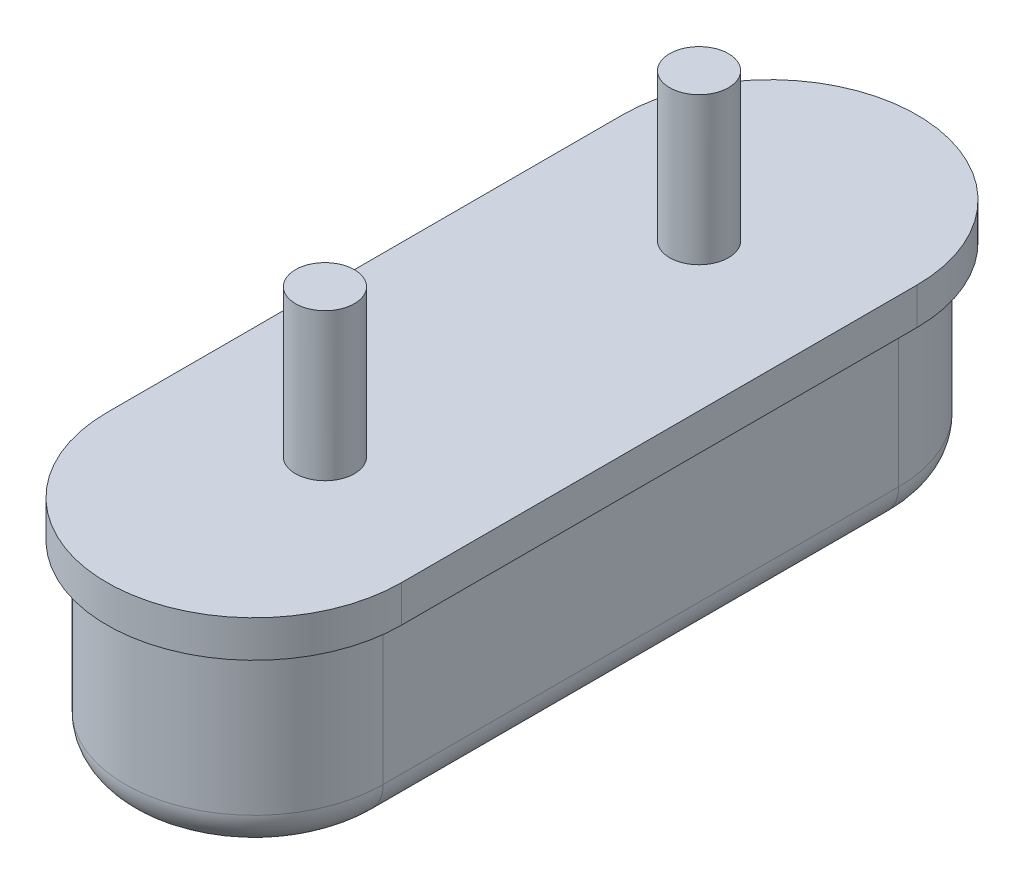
from build123d import *

# Parameters (mm, degrees)
BOSS_EXTRUDE1_DEPTH = 3
CUT_EXTRUDE1_START  = -2.5
CUT_EXTRUDE1_DEPTH  = 2.5
FILLET1_R           = 0.5
SKETCH3_R           = 0.4
BOSS_EXTRUDE2_DEPTH = 2
CUT_EXTRUDE2_DEPTH  = 0.05
FILLET2_R           = 0.1


with BuildPart() as part:
    # Sketch1 → Boss-Extrude1 (new body)
    with BuildSketch(Plane.XZ):
        with BuildLine():
            Line((2, 3.5), (2, -3.5))
            ThreePointArc((2, -3.5), (0, -5.5), (-2, -3.5))
            Line((-2, -3.5), (-2, 3.5))
            ThreePointArc((-2, 3.5), (0, 5.5), (2, 3.5))
        make_face()
    extrude(amount=BOSS_EXTRUDE1_DEPTH)

    # Sketch2 → Cut-Extrude1 (cut)
    with BuildSketch(Plane.XZ.offset(3).offset(CUT_EXTRUDE1_START)):
        with BuildLine():
            Line((2, 3.5), (2, -3.5))
            ThreePointArc((2, -3.5), (0, -5.5), (-2, -3.5))
            Line((-2, -3.5), (-2, 3.5))
            ThreePointArc((-2, 3.5), (0, 5.5), (2, 3.5))
        make_face()
        with BuildLine():
            Line((1.75, 3.5), (1.75, -3.5))
            ThreePointArc((1.75, -3.5), (0, -5.25), (-1.75, -3.5))
            Line((-1.75, -3.5), (-1.75, 3.5))
            ThreePointArc((-1.75, 3.5), (0, 5.25), (1.75, 3.5))
        make_face(mode=Mode.SUBTRACT)
    extrude(amount=CUT_EXTRUDE1_DEPTH, mode=Mode.SUBTRACT)

    # Fillet1
    fillet1_edges = [part.edges().sort_by_distance(p)[0] for p in [
        (0, -3, 5.25),
        (1.75, -3, 0),
        (0, -3, -5.25),
        (-1.75, -3, 0),
    ]]
    fillet(fillet1_edges, radius=FILLET1_R)

    # Sketch3 → Boss-Extrude2 (add)
    with BuildSketch(Plane(origin=(0, 0, 0), x_dir=(1, 0, 0), z_dir=(0, 1, 0))):
        with Locations(Location((0, 2.54, 0), (0, 0, 90))):
            Circle(SKETCH3_R)
        with Locations(Location((0, -2.54, 0), (0, 0, 90))):
            Circle(SKETCH3_R)
    extrude(amount=BOSS_EXTRUDE2_DEPTH)

    # Sketch4 → Cut-Extrude2 (cut)
    # profile 1 of 10: a face of its own
    with BuildSketch(Plane.XZ.offset(3)):
        with BuildLine():
            add(Edge.make_bspline(
                [(-0.455693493, -2.719669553), (-0.454052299, -2.717742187), (-0.45091746, -2.714060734), (-0.445315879, -2.709924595), (-0.439274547, -2.707354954), (-0.435097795, -2.707003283), (-0.433005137, -2.706827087)],
                knots=[0, 0, 0, 0, 1.123151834, 2.145327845, 3.070762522, 4, 4, 4, 4], degree=3))
            add(Edge.make_bspline(
                [(-0.433005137, -2.706827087), (-0.429264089, -2.707058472), (-0.422218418, -2.707494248), (-0.412509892, -2.711149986), (-0.404998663, -2.717805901), (-0.40187447, -2.72354653), (-0.400256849, -2.726518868)],
                knots=[0, 0, 0, 0, 1.103829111, 2.078887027, 3.005301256, 4, 4, 4, 4], degree=3))
            add(Edge.make_bspline(
                [(-0.400256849, -2.726518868), (-0.399431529, -2.728776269), (-0.398108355, -2.732395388), (-0.397647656, -2.736212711), (-0.397474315, -2.737649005)],
                knots=[0, 0, 0, 0, 1.247486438, 2, 2, 2, 2], degree=3))
            add(Edge.make_bspline(
                [(-0.397474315, -2.737649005), (-0.397879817, -2.740597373), (-0.398883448, -2.74789468), (-0.403174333, -2.758696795), (-0.407427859, -2.769118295), (-0.409352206, -2.775735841), (-0.41010274, -2.778316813)],
                knots=[0, 0, 0, 0, 0.834115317, 2.06446299, 3.24510253, 4, 4, 4, 4], degree=3))
            add(Edge.make_bspline(
                [(-0.41010274, -2.778316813), (-0.41552906, -2.796866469), (-0.426127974, -2.833098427), (-0.43680466, -2.887387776), (-0.443979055, -2.939867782), (-0.444801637, -2.974355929), (-0.445205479, -2.991287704)],
                knots=[0, 0, 0, 0, 1.070143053, 2.090247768, 3.06241719, 4, 4, 4, 4], degree=3))
            add(Edge.make_bspline(
                [(-0.445205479, -2.991287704), (-0.445205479, -2.992714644), (-0.445205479, -2.996496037), (-0.445205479, -3.00027743), (-0.445205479, -3.002631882)],
                knots=[0, 0, 0, 0, 0.754716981, 2, 2, 2, 2], degree=3))
            add(Edge.make_bspline(
                [(-0.445205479, -3.002631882), (-0.445205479, -3.004700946), (-0.445205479, -3.008410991), (-0.445205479, -3.012121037), (-0.445205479, -3.013762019)],
                knots=[0, 0, 0, 0, 1.115384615, 2, 2, 2, 2], degree=3))
            add(Edge.make_bspline(
                [(-0.445205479, -3.013762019), (-0.444604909, -3.018918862), (-0.443409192, -3.02918598), (-0.439628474, -3.044126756), (-0.43478806, -3.058701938), (-0.428039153, -3.072519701), (-0.420132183, -3.085918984), (-0.410637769, -3.098599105), (-0.399588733, -3.110622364), (-0.383382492, -3.125745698), (-0.361097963, -3.141813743), (-0.332417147, -3.156244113), (-0.302022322, -3.165024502), (-0.281234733, -3.166063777), (-0.270761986, -3.166587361)],
                knots=[0, 0, 0, 0, 0.737223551, 1.467789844, 2.186217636, 2.916572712, 3.648826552, 4.395270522, 5.163445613, 5.967152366, 7.54345389, 9.049273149, 10.513429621, 12, 12, 12, 12], degree=3))
            add(Edge.make_bspline(
                [(-0.270761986, -3.166587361), (-0.264258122, -3.166449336), (-0.251473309, -3.166178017), (-0.232768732, -3.163251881), (-0.214901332, -3.158799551), (-0.197904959, -3.152541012), (-0.181683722, -3.14462467), (-0.166496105, -3.134642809), (-0.151942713, -3.123092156), (-0.143306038, -3.114042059), (-0.138912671, -3.109438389)],
                knots=[0, 0, 0, 0, 1.05273353, 2.069385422, 3.058871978, 4.031475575, 4.998017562, 5.975757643, 6.970293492, 8, 8, 8, 8], degree=3))
            Line((-0.138912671, -3.109438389), (-0.119006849, -3.08246921))
            Line((-0.119006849, -3.08246921), (0.045376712, -2.755842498))
            add(Edge.make_bspline(
                [(0.045376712, -2.755842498), (0.051595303, -2.747117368), (0.063738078, -2.730080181), (0.085032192, -2.707745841), (0.107702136, -2.688358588), (0.132555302, -2.672972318), (0.158970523, -2.660734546), (0.18715264, -2.652286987), (0.217049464, -2.646943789), (0.237562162, -2.646345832), (0.24807363, -2.646039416)],
                knots=[0, 0, 0, 0, 1.066206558, 2.081935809, 3.065751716, 4.030169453, 4.984343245, 5.957937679, 6.953571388, 8, 8, 8, 8], degree=3))
            add(Edge.make_bspline(
                [(0.24807363, -2.646039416), (0.25293351, -2.646064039), (0.261027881, -2.646105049), (0.269053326, -2.647128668), (0.272260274, -2.647537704)],
                knots=[0, 0, 0, 0, 1.200805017, 2, 2, 2, 2], degree=3))
            add(Edge.make_bspline(
                [(0.272260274, -2.647537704), (0.282382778, -2.648952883), (0.302688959, -2.651791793), (0.332326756, -2.661533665), (0.360977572, -2.675633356), (0.388307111, -2.693762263), (0.413506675, -2.714935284), (0.435149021, -2.739050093), (0.453293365, -2.765211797), (0.462032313, -2.784374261), (0.466395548, -2.793941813)],
                knots=[0, 0, 0, 0, 0.961840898, 1.929494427, 2.924998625, 3.963894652, 5.013530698, 6.018236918, 7.01053329, 8, 8, 8, 8], degree=3))
            add(Edge.make_bspline(
                [(0.466395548, -2.793941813), (0.469497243, -2.802089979), (0.475661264, -2.818282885), (0.481735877, -2.84343494), (0.485523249, -2.868882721), (0.486041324, -2.885966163), (0.48630137, -2.894541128)],
                knots=[0, 0, 0, 0, 1.013198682, 2.013536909, 3.002902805, 4, 4, 4, 4], degree=3))
            add(Edge.make_bspline(
                [(0.48630137, -2.894541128), (0.485731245, -2.908765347), (0.484541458, -2.938449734), (0.476816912, -2.984453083), (0.464347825, -3.033607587), (0.452748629, -3.066854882), (0.446703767, -3.084181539)],
                knots=[0, 0, 0, 0, 0.876921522, 1.830039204, 2.869136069, 4, 4, 4, 4], degree=3))
            add(Edge.make_bspline(
                [(0.446703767, -3.084181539), (0.441342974, -3.097543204), (0.430823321, -3.123763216), (0.411748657, -3.161036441), (0.390514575, -3.195890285), (0.374123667, -3.217236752), (0.366010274, -3.227803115)],
                knots=[0, 0, 0, 0, 1.043998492, 2.048670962, 3.034104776, 4, 4, 4, 4], degree=3))
            add(Edge.make_bspline(
                [(0.366010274, -3.227803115), (0.363489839, -3.229872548), (0.358379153, -3.234068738), (0.351795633, -3.234740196), (0.348458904, -3.235080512)],
                knots=[0, 0, 0, 0, 0.986338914, 2, 2, 2, 2], degree=3))
            add(Edge.make_bspline(
                [(0.348458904, -3.235080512), (0.346869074, -3.234945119), (0.343284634, -3.23463986), (0.340008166, -3.233135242), (0.338184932, -3.232297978)],
                knots=[0, 0, 0, 0, 0.887072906, 2, 2, 2, 2], degree=3))
            add(Edge.make_bspline(
                [(0.338184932, -3.232297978), (0.334650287, -3.231008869), (0.328100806, -3.22862023), (0.320261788, -3.222045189), (0.315415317, -3.213492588), (0.314902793, -3.207102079), (0.314640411, -3.203830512)],
                knots=[0, 0, 0, 0, 1.12649361, 2.087323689, 3.020821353, 4, 4, 4, 4], degree=3))
            add(Edge.make_bspline(
                [(0.314640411, -3.203830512), (0.314838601, -3.200937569), (0.315246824, -3.194978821), (0.317672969, -3.189517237), (0.318921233, -3.186707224)],
                knots=[0, 0, 0, 0, 0.970990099, 2, 2, 2, 2], degree=3))
            add(Edge.make_bspline(
                [(0.318921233, -3.186707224), (0.326807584, -3.174543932), (0.342407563, -3.150483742), (0.362400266, -3.112903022), (0.379727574, -3.074955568), (0.393640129, -3.036360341), (0.404400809, -2.997202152), (0.412046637, -2.957558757), (0.417017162, -2.917355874), (0.41754368, -2.890346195), (0.417808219, -2.876775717)],
                knots=[0, 0, 0, 0, 1.052998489, 2.082934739, 3.090014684, 4.082250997, 5.060833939, 6.038001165, 7.014232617, 8, 8, 8, 8], degree=3))
            add(Edge.make_bspline(
                [(0.417808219, -2.876775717), (0.417213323, -2.87126207), (0.416036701, -2.860356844), (0.412220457, -2.844499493), (0.407454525, -2.829115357), (0.400579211, -2.814572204), (0.392827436, -2.800374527), (0.383176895, -2.787023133), (0.372295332, -2.774139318), (0.355898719, -2.758174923), (0.333778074, -2.740759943), (0.304374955, -2.725638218), (0.273191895, -2.716219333), (0.251634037, -2.715096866), (0.240796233, -2.714532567)],
                knots=[0, 0, 0, 0, 0.759082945, 1.501360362, 2.230976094, 2.961573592, 3.70127141, 4.444513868, 5.214348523, 6.009346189, 7.577583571, 9.051056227, 10.517474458, 12, 12, 12, 12], degree=3))
            add(Edge.make_bspline(
                [(0.240796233, -2.714532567), (0.231204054, -2.714963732), (0.212397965, -2.71580906), (0.185169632, -2.721863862), (0.159810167, -2.732141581), (0.144893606, -2.742224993), (0.137414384, -2.747280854)],
                knots=[0, 0, 0, 0, 1.043203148, 2.045267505, 3.019889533, 4, 4, 4, 4], degree=3))
            add(Edge.make_bspline(
                [(0.137414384, -2.747280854), (0.131568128, -2.752130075), (0.119528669, -2.762116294), (0.103531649, -2.780532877), (0.088286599, -2.801605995), (0.079602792, -2.817312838), (0.075128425, -2.825405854)],
                knots=[0, 0, 0, 0, 0.904242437, 1.862147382, 2.898462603, 4, 4, 4, 4], degree=3))
            add(Edge.make_bspline(
                [(0.075128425, -2.825405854), (0.067965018, -2.84012456), (0.053596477, -2.869647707), (0.038713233, -2.898914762), (0.03125, -2.913590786)],
                knots=[0, 0, 0, 0, 0.997095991, 2, 2, 2, 2], degree=3))
            Line((0.03125, -2.913590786), (-0.070633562, -3.119926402))
            add(Edge.make_bspline(
                [(-0.070633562, -3.119926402), (-0.076830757, -3.129089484), (-0.088921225, -3.146966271), (-0.110444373, -3.170323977), (-0.133304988, -3.190602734), (-0.158483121, -3.206671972), (-0.185176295, -3.21951854), (-0.213806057, -3.228431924), (-0.244196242, -3.234283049), (-0.26516862, -3.234810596), (-0.275898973, -3.235080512)],
                knots=[0, 0, 0, 0, 1.075829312, 2.098897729, 3.083886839, 4.04363121, 4.997725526, 5.960157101, 6.956330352, 8, 8, 8, 8], degree=3))
            add(Edge.make_bspline(
                [(-0.275898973, -3.235080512), (-0.279754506, -3.234983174), (-0.287763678, -3.234780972), (-0.295736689, -3.2339916), (-0.299871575, -3.233582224)],
                knots=[0, 0, 0, 0, 0.962779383, 2, 2, 2, 2], degree=3))
            add(Edge.make_bspline(
                [(-0.299871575, -3.233582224), (-0.310137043, -3.23201127), (-0.330721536, -3.228861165), (-0.36065002, -3.218933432), (-0.389598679, -3.205074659), (-0.417085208, -3.187422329), (-0.442455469, -3.166845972), (-0.463944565, -3.143160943), (-0.482301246, -3.117566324), (-0.490949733, -3.098616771), (-0.495291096, -3.089104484)],
                knots=[0, 0, 0, 0, 0.979088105, 1.963284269, 2.963623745, 4.002614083, 5.041080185, 6.037533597, 7.014882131, 8, 8, 8, 8], degree=3))
            add(Edge.make_bspline(
                [(-0.495291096, -3.089104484), (-0.498212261, -3.081317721), (-0.504166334, -3.06544633), (-0.50929197, -3.039892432), (-0.513292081, -3.012818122), (-0.513560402, -2.994087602), (-0.51369863, -2.984438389)],
                knots=[0, 0, 0, 0, 0.932067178, 1.899788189, 2.918055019, 4, 4, 4, 4], degree=3))
            add(Edge.make_bspline(
                [(-0.51369863, -2.984438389), (-0.513351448, -2.971294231), (-0.512620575, -2.943623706), (-0.506798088, -2.900462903), (-0.498097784, -2.853554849), (-0.489789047, -2.821435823), (-0.485445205, -2.804643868)],
                knots=[0, 0, 0, 0, 0.864098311, 1.819063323, 2.859797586, 4, 4, 4, 4], degree=3))
            add(Edge.make_bspline(
                [(-0.485445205, -2.804643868), (-0.483068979, -2.796281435), (-0.478540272, -2.780343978), (-0.471302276, -2.757817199), (-0.463883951, -2.737776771), (-0.458327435, -2.725492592), (-0.455693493, -2.719669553)],
                knots=[0, 0, 0, 0, 1.157267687, 2.20556675, 3.149389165, 4, 4, 4, 4], degree=3))
        make_face()
    # profile 2 of 10: a face of its own
    with BuildSketch(Plane.XZ.offset(3)):
        with BuildLine():
            add(Edge.make_bspline(
                [(-0.51369863, -2.094241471), (-0.513528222, -2.087599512), (-0.513187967, -2.074337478), (-0.510610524, -2.054531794), (-0.505946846, -2.035059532), (-0.500129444, -2.015685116), (-0.491968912, -1.996856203), (-0.482619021, -1.978065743), (-0.471219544, -1.959714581), (-0.453902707, -1.93603194), (-0.429982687, -1.908551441), (-0.397832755, -1.880337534), (-0.362712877, -1.857494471), (-0.337369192, -1.846803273), (-0.324700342, -1.841458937)],
                knots=[0, 0, 0, 0, 0.715319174, 1.428281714, 2.145949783, 2.870252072, 3.603830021, 4.353019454, 5.12930605, 5.927051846, 7.51164333, 9.042016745, 10.521357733, 12, 12, 12, 12], degree=3))
            add(Edge.make_bspline(
                [(-0.324700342, -1.841458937), (-0.316746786, -1.838832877), (-0.300867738, -1.833590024), (-0.276598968, -1.828087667), (-0.252092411, -1.824731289), (-0.235741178, -1.824325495), (-0.227525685, -1.824121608)],
                knots=[0, 0, 0, 0, 1.012942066, 2.022309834, 3.006331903, 4, 4, 4, 4], degree=3))
            add(Edge.make_bspline(
                [(-0.227525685, -1.824121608), (-0.217591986, -1.824333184), (-0.198065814, -1.824749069), (-0.169504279, -1.829070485), (-0.142066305, -1.835374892), (-0.115882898, -1.844539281), (-0.091149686, -1.856774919), (-0.067399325, -1.871150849), (-0.04484105, -1.888205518), (-0.031255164, -1.901521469), (-0.024400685, -1.908239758)],
                knots=[0, 0, 0, 0, 1.05355145, 2.070913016, 3.059082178, 4.038625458, 5.007219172, 5.982538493, 6.982131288, 8, 8, 8, 8], degree=3))
            add(Edge.make_bspline(
                [(-0.024400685, -1.908239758), (-0.017544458, -1.91582044), (-0.003963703, -1.930836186), (0.013625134, -1.955366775), (0.028425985, -1.981227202), (0.040822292, -2.008227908), (0.049897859, -2.036826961), (0.056805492, -2.066504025), (0.0609805, -2.097547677), (0.061420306, -2.118629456), (0.061643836, -2.12934421)],
                knots=[0, 0, 0, 0, 1.007274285, 1.995199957, 2.969022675, 3.941930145, 4.918594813, 5.922053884, 6.94388981, 8, 8, 8, 8], degree=3))
            Line((0.061643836, -2.12934421), (0.061643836, -2.344669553))
            Line((0.061643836, -2.344669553), (0.464469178, -2.344669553))
            add(Edge.make_bspline(
                [(0.464469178, -2.344669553), (0.467067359, -2.345719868), (0.472262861, -2.347820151), (0.478608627, -2.354272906), (0.483454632, -2.362913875), (0.485312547, -2.369725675), (0.48630137, -2.37335106)],
                knots=[0, 0, 0, 0, 0.882085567, 1.763879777, 2.80988923, 4, 4, 4, 4], degree=3))
            add(Edge.make_bspline(
                [(0.48630137, -2.37335106), (0.485826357, -2.378328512), (0.484879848, -2.388246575), (0.478963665, -2.400073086), (0.469979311, -2.407211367), (0.459398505, -2.410840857), (0.445414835, -2.412651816), (0.434937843, -2.412980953), (0.429152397, -2.413162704)],
                knots=[0, 0, 0, 0, 1.118428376, 2.228578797, 2.843546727, 3.649160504, 4.701854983, 6, 6, 6, 6], degree=3))
            Line((0.429152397, -2.413162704), (-0.490796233, -2.413162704))
            add(Edge.make_bspline(
                [(-0.490796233, -2.413162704), (-0.494796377, -2.411371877), (-0.502827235, -2.407776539), (-0.508212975, -2.400816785), (-0.510916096, -2.397323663)],
                knots=[0, 0, 0, 0, 0.996193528, 2, 2, 2, 2], degree=3))
            Line((-0.510916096, -2.397323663), (-0.51369863, -2.387263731))
            Line((-0.51369863, -2.387263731), (-0.51369863, -2.094241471))
        make_face()
        with BuildLine():
            Line((-0.445205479, -2.094669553), (-0.445205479, -2.344669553))
            Line((-0.445205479, -2.344669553), (-0.006849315, -2.344669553))
            Line((-0.006849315, -2.344669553), (-0.006849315, -2.117143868))
            add(Edge.make_bspline(
                [(-0.006849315, -2.117143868), (-0.007075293, -2.10870861), (-0.007522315, -2.092022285), (-0.011723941, -2.06744246), (-0.018643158, -2.043786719), (-0.028072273, -2.020894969), (-0.040437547, -1.999019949), (-0.055228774, -1.97790999), (-0.072995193, -1.957845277), (-0.086425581, -1.945575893), (-0.093321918, -1.939275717)],
                knots=[0, 0, 0, 0, 0.990168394, 1.958715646, 2.918778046, 3.88059452, 4.859814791, 5.864243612, 6.903315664, 8, 8, 8, 8], degree=3))
            add(Edge.make_bspline(
                [(-0.093321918, -1.939275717), (-0.097955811, -1.935532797), (-0.107183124, -1.92807965), (-0.122317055, -1.918787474), (-0.137972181, -1.910519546), (-0.154508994, -1.903815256), (-0.171934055, -1.899017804), (-0.190025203, -1.895375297), (-0.208834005, -1.892859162), (-0.22166693, -1.892696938), (-0.228167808, -1.892614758)],
                knots=[0, 0, 0, 0, 0.979790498, 1.951023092, 2.917769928, 3.892831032, 4.881942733, 5.888684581, 6.930453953, 8, 8, 8, 8], degree=3))
            add(Edge.make_bspline(
                [(-0.228167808, -1.892614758), (-0.235603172, -1.892800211), (-0.250188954, -1.89316401), (-0.271579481, -1.896639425), (-0.292307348, -1.901483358), (-0.305352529, -1.906848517), (-0.311857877, -1.909524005)],
                knots=[0, 0, 0, 0, 1.036956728, 2.034174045, 3.019685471, 4, 4, 4, 4], degree=3))
            add(Edge.make_bspline(
                [(-0.311857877, -1.909524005), (-0.320856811, -1.913826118), (-0.3388743, -1.922439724), (-0.363430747, -1.940321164), (-0.386211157, -1.961306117), (-0.40639612, -1.985452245), (-0.423609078, -2.011333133), (-0.435836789, -2.038605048), (-0.443962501, -2.06637788), (-0.44479245, -2.085268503), (-0.445205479, -2.094669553)],
                knots=[0, 0, 0, 0, 0.994982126, 1.992133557, 3.021473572, 4.084156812, 5.130374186, 6.11645094, 7.062638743, 8, 8, 8, 8], degree=3))
        make_face(mode=Mode.SUBTRACT)
    # profile 3 of 10: a face of its own
    with BuildSketch(Plane.XZ.offset(3)):
        with BuildLine():
            add(Edge.make_bspline(
                [(-0.495077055, -1.013547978), (-0.492676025, -1.012714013), (-0.48856912, -1.011287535), (-0.484244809, -1.010918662), (-0.48244863, -1.010765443)],
                knots=[0, 0, 0, 0, 1.169264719, 2, 2, 2, 2], degree=3))
            add(Edge.make_bspline(
                [(-0.48244863, -1.010765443), (-0.478616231, -1.011167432), (-0.47068719, -1.011999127), (-0.464329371, -1.016830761), (-0.461044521, -1.019327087)],
                knots=[0, 0, 0, 0, 0.966674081, 2, 2, 2, 2], degree=3))
            Line((-0.461044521, -1.019327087), (-0.126284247, -1.322195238))
            Line((-0.126284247, -1.322195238), (0.447773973, -1.006484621))
            add(Edge.make_bspline(
                [(0.447773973, -1.006484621), (0.451060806, -1.006553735), (0.457023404, -1.006679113), (0.465134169, -1.007847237), (0.471530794, -1.010100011), (0.474782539, -1.012480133), (0.476241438, -1.013547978)],
                knots=[0, 0, 0, 0, 1.31758118, 2.390205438, 3.277763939, 4, 4, 4, 4], degree=3))
            add(Edge.make_bspline(
                [(0.476241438, -1.013547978), (0.479148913, -1.017972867), (0.485005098, -1.026885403), (0.485867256, -1.037517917), (0.48630137, -1.042871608)],
                knots=[0, 0, 0, 0, 0.992958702, 2, 2, 2, 2], degree=3))
            add(Edge.make_bspline(
                [(0.48630137, -1.042871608), (0.485290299, -1.04571805), (0.48340091, -1.051037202), (0.478736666, -1.057697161), (0.473035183, -1.062729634), (0.468465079, -1.064474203), (0.466181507, -1.065345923)],
                knots=[0, 0, 0, 0, 1.148250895, 2.145738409, 3.073469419, 4, 4, 4, 4], degree=3))
            Line((0.466181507, -1.065345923), (-0.078981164, -1.362863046))
            Line((-0.078981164, -1.362863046), (0.101241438, -1.522751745))
            Line((0.101241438, -1.522751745), (0.463398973, -1.522751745))
            add(Edge.make_bspline(
                [(0.463398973, -1.522751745), (0.466653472, -1.524229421), (0.473479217, -1.527328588), (0.480168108, -1.536825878), (0.485477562, -1.547132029), (0.486032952, -1.55479373), (0.48630137, -1.558496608)],
                knots=[0, 0, 0, 0, 0.938899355, 1.969177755, 3.018509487, 4, 4, 4, 4], degree=3))
            add(Edge.make_bspline(
                [(0.48630137, -1.558496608), (0.486175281, -1.560230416), (0.485899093, -1.56402818), (0.484356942, -1.567516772), (0.483518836, -1.569412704)],
                knots=[0, 0, 0, 0, 0.913067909, 2, 2, 2, 2], degree=3))
            add(Edge.make_bspline(
                [(0.483518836, -1.569412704), (0.481727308, -1.572883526), (0.477938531, -1.580223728), (0.465275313, -1.586711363), (0.449013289, -1.590888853), (0.436406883, -1.591117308), (0.429366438, -1.591244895)],
                knots=[0, 0, 0, 0, 0.740913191, 1.566905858, 2.641161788, 4, 4, 4, 4], degree=3))
            Line((0.429366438, -1.591244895), (-0.489511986, -1.591244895))
            add(Edge.make_bspline(
                [(-0.489511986, -1.591244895), (-0.493151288, -1.589611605), (-0.500177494, -1.586458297), (-0.508116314, -1.578213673), (-0.513045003, -1.567820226), (-0.51347167, -1.560197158), (-0.51369863, -1.556142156)],
                knots=[0, 0, 0, 0, 1.040780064, 2.009378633, 2.941112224, 4, 4, 4, 4], degree=3))
            add(Edge.make_bspline(
                [(-0.51369863, -1.556142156), (-0.513576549, -1.552596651), (-0.513346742, -1.545922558), (-0.509433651, -1.537091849), (-0.503657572, -1.529750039), (-0.498154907, -1.527118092), (-0.495291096, -1.52574832)],
                knots=[0, 0, 0, 0, 1.112554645, 2.094284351, 3.00818775, 4, 4, 4, 4], degree=3))
            Line((-0.495291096, -1.52574832), (-0.479666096, -1.522751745))
            Line((-0.479666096, -1.522751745), (0.004494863, -1.522751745))
            Line((0.004494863, -1.522751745), (-0.013912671, -1.504558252))
            Line((-0.013912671, -1.504558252), (-0.506635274, -1.061279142))
            add(Edge.make_bspline(
                [(-0.506635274, -1.061279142), (-0.508679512, -1.057369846), (-0.511953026, -1.051109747), (-0.513222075, -1.044187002), (-0.51369863, -1.041587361)],
                knots=[0, 0, 0, 0, 1.248956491, 2, 2, 2, 2], degree=3))
            add(Edge.make_bspline(
                [(-0.51369863, -1.041587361), (-0.513439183, -1.040153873), (-0.512709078, -1.036119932), (-0.510223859, -1.02896096), (-0.504912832, -1.019984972), (-0.498526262, -1.015805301), (-0.495077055, -1.013547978)],
                knots=[0, 0, 0, 0, 0.500659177, 1.408892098, 2.600615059, 4, 4, 4, 4], degree=3))
        make_face()
    # profile 4 of 10: a face of its own
    with BuildSketch(Plane.XZ.offset(3)):
        with BuildLine():
            Line((-0.496575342, -0.485936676), (-0.48244863, -0.481655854))
            Line((-0.48244863, -0.481655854), (0.463613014, -0.481655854))
            add(Edge.make_bspline(
                [(0.463613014, -0.481655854), (0.466686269, -0.483038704), (0.474251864, -0.486442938), (0.479126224, -0.493243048), (0.482020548, -0.497280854)],
                knots=[0, 0, 0, 0, 0.812429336, 2, 2, 2, 2], degree=3))
            add(Edge.make_bspline(
                [(0.482020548, -0.497280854), (0.483268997, -0.500453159), (0.485813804, -0.506919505), (0.486136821, -0.513863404), (0.48630137, -0.517400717)],
                knots=[0, 0, 0, 0, 0.981173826, 2, 2, 2, 2], degree=3))
            add(Edge.make_bspline(
                [(0.48630137, -0.517400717), (0.486175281, -0.519134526), (0.485899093, -0.52293229), (0.484356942, -0.526420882), (0.483518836, -0.528316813)],
                knots=[0, 0, 0, 0, 0.913067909, 2, 2, 2, 2], degree=3))
            add(Edge.make_bspline(
                [(0.483518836, -0.528316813), (0.481727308, -0.531787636), (0.477938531, -0.539127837), (0.465275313, -0.545615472), (0.449013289, -0.549792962), (0.436406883, -0.550021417), (0.429366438, -0.550149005)],
                knots=[0, 0, 0, 0, 0.740913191, 1.566905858, 2.641161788, 4, 4, 4, 4], degree=3))
            Line((0.429366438, -0.550149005), (-0.404751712, -0.550149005))
            Line((-0.404751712, -0.550149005), (-0.247431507, -0.706613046))
            add(Edge.make_bspline(
                [(-0.247431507, -0.706613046), (-0.246183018, -0.708988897), (-0.243646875, -0.713815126), (-0.243317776, -0.719259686), (-0.243150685, -0.722024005)],
                knots=[0, 0, 0, 0, 0.984557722, 2, 2, 2, 2], degree=3))
            add(Edge.make_bspline(
                [(-0.243150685, -0.722024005), (-0.2432256, -0.722093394), (-0.243788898, -0.722615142), (-0.243674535, -0.724949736), (-0.244888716, -0.728454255), (-0.245844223, -0.733626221), (-0.247805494, -0.739208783), (-0.251379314, -0.744440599), (-0.256695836, -0.748475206), (-0.260872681, -0.750361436), (-0.263056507, -0.751347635)],
                knots=[0, 0, 0, 0, 0.064375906, 0.484055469, 1.323414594, 2.493746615, 3.804393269, 5.079783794, 6.473191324, 8, 8, 8, 8], degree=3))
            add(Edge.make_bspline(
                [(-0.263056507, -0.751347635), (-0.264993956, -0.752596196), (-0.268846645, -0.755079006), (-0.27341428, -0.755446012), (-0.275684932, -0.755628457)],
                knots=[0, 0, 0, 0, 1.005764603, 2, 2, 2, 2], degree=3))
            add(Edge.make_bspline(
                [(-0.275684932, -0.755628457), (-0.279764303, -0.754869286), (-0.289096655, -0.753132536), (-0.295990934, -0.746512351), (-0.299871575, -0.742785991)],
                knots=[0, 0, 0, 0, 0.874243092, 2, 2, 2, 2], degree=3))
            add(Edge.make_bspline(
                [(-0.299871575, -0.742785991), (-0.302816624, -0.739880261), (-0.307952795, -0.734812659), (-0.31422484, -0.728173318), (-0.318423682, -0.72402357), (-0.320419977, -0.722024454), (-0.321061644, -0.721381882)],
                knots=[0, 0, 0, 0, 1.648173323, 2.874418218, 3.638205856, 4, 4, 4, 4], degree=3))
            Line((-0.321061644, -0.721381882), (-0.509417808, -0.528744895))
            add(Edge.make_bspline(
                [(-0.509417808, -0.528744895), (-0.510664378, -0.526512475), (-0.513367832, -0.521670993), (-0.51358279, -0.516114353), (-0.51369863, -0.513119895)],
                knots=[0, 0, 0, 0, 0.922205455, 2, 2, 2, 2], degree=3))
            add(Edge.make_bspline(
                [(-0.51369863, -0.513119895), (-0.513520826, -0.510018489), (-0.513182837, -0.504123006), (-0.509866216, -0.49606683), (-0.504233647, -0.489635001), (-0.499188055, -0.487198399), (-0.496575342, -0.485936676)],
                knots=[0, 0, 0, 0, 1.081312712, 2.055474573, 2.993084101, 4, 4, 4, 4], degree=3))
        make_face()
    # profile 5 of 10: a face of its own
    with BuildSketch(Plane.XZ.offset(3)):
        with BuildLine():
            add(Edge.make_bspline(
                [(-0.496789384, 0.134568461), (-0.494960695, 0.135398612), (-0.490564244, 0.137394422), (-0.485711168, 0.137367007), (-0.482876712, 0.137350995)],
                knots=[0, 0, 0, 0, 0.831893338, 2, 2, 2, 2], degree=3))
            add(Edge.make_bspline(
                [(-0.482876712, 0.137350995), (-0.478573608, 0.137235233), (-0.470803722, 0.137026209), (-0.464647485, 0.132366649), (-0.461900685, 0.130287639)],
                knots=[0, 0, 0, 0, 1.10763643, 2, 2, 2, 2], degree=3))
            add(Edge.make_bspline(
                [(-0.461900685, 0.130287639), (-0.460353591, 0.126852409), (-0.456919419, 0.119227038), (-0.450720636, 0.106937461), (-0.444285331, 0.091976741), (-0.439317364, 0.081399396), (-0.436643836, 0.075707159)],
                knots=[0, 0, 0, 0, 0.751643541, 1.668465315, 2.745276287, 4, 4, 4, 4], degree=3))
            add(Edge.make_bspline(
                [(-0.436643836, 0.075707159), (-0.432606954, 0.067732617), (-0.424578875, 0.051873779), (-0.410744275, 0.029080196), (-0.395574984, 0.007287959), (-0.379003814, -0.013599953), (-0.360975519, -0.033533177), (-0.341529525, -0.05254359), (-0.320644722, -0.070610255), (-0.298533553, -0.087577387), (-0.275569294, -0.10336702), (-0.251987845, -0.117537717), (-0.228016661, -0.129924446), (-0.203746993, -0.140740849), (-0.179028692, -0.149664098), (-0.154011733, -0.157304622), (-0.128493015, -0.162799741), (-0.111316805, -0.165325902), (-0.102739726, -0.166587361)],
                knots=[0, 0, 0, 0, 0.998886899, 1.98646957, 2.977684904, 3.965460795, 4.964984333, 5.980200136, 7.003622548, 8.050124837, 9.094314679, 10.117457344, 11.123419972, 12.108971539, 13.085444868, 14.059472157, 15.030981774, 16, 16, 16, 16], degree=3))
            Line((-0.102739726, -0.166587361), (-0.102739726, 0.012136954))
            add(Edge.make_bspline(
                [(-0.102739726, 0.012136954), (-0.102739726, 0.014491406), (-0.102739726, 0.020127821), (-0.102739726, 0.025764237), (-0.102739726, 0.0290462)],
                knots=[0, 0, 0, 0, 0.835443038, 2, 2, 2, 2], degree=3))
            add(Edge.make_bspline(
                [(-0.102739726, 0.0290462), (-0.102483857, 0.038627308), (-0.101984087, 0.05734136), (-0.097145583, 0.084538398), (-0.089250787, 0.110046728), (-0.077986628, 0.133767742), (-0.063729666, 0.15578066), (-0.04640643, 0.176158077), (-0.02573098, 0.194631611), (-0.010121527, 0.205166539), (-0.002140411, 0.21055305)],
                knots=[0, 0, 0, 0, 1.056467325, 2.063517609, 3.037174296, 3.995137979, 4.951676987, 5.923517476, 6.938294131, 8, 8, 8, 8], degree=3))
            add(Edge.make_bspline(
                [(-0.002140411, 0.21055305), (0.007129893, 0.215995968), (0.025276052, 0.22665021), (0.054558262, 0.237183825), (0.084232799, 0.243907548), (0.104272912, 0.244216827), (0.114297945, 0.244371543)],
                knots=[0, 0, 0, 0, 1.046831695, 2.049120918, 3.024075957, 4, 4, 4, 4], degree=3))
            add(Edge.make_bspline(
                [(0.114297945, 0.244371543), (0.117651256, 0.244371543), (0.1262129, 0.244371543), (0.140339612, 0.244371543), (0.155179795, 0.244371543), (0.164811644, 0.244371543), (0.168878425, 0.244371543)],
                knots=[0, 0, 0, 0, 0.737254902, 1.882352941, 3.105882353, 4, 4, 4, 4], degree=3))
            add(Edge.make_bspline(
                [(0.168878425, 0.244371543), (0.172945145, 0.244469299), (0.182505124, 0.244699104), (0.1920661, 0.244491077), (0.197559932, 0.244371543)],
                knots=[0, 0, 0, 0, 0.850780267, 2, 2, 2, 2], degree=3))
            add(Edge.make_bspline(
                [(0.197559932, 0.244371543), (0.202910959, 0.244371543), (0.211972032, 0.244371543), (0.221033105, 0.244371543), (0.224743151, 0.244371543)],
                knots=[0, 0, 0, 0, 1.181102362, 2, 2, 2, 2], degree=3))
            add(Edge.make_bspline(
                [(0.224743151, 0.244371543), (0.237526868, 0.244079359), (0.261383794, 0.243534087), (0.294508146, 0.23974967), (0.322435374, 0.232873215), (0.33820757, 0.225208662), (0.345462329, 0.221683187)],
                knots=[0, 0, 0, 0, 1.236389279, 2.307345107, 3.221427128, 4, 4, 4, 4], degree=3))
            add(Edge.make_bspline(
                [(0.345462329, 0.221683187), (0.355700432, 0.21656337), (0.375986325, 0.206418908), (0.403331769, 0.185808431), (0.427394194, 0.161155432), (0.448169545, 0.133122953), (0.46503828, 0.102673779), (0.477398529, 0.07073732), (0.484998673, 0.037678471), (0.485866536, 0.015243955), (0.48630137, 0.004003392)],
                knots=[0, 0, 0, 0, 1.002932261, 1.987221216, 2.987864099, 4.017243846, 5.040166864, 6.033199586, 7.01455664, 8, 8, 8, 8], degree=3))
            add(Edge.make_bspline(
                [(0.48630137, 0.004003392), (0.485989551, -0.00643522), (0.485381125, -0.02680324), (0.480111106, -0.056532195), (0.471360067, -0.084464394), (0.459007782, -0.11065361), (0.443233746, -0.13504885), (0.423957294, -0.157621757), (0.401344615, -0.178675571), (0.384082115, -0.190627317), (0.375214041, -0.196767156)],
                knots=[0, 0, 0, 0, 1.043019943, 2.03516033, 3.007511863, 3.961611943, 4.921242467, 5.903097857, 6.922781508, 8, 8, 8, 8], degree=3))
            add(Edge.make_bspline(
                [(0.375214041, -0.196767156), (0.365658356, -0.202619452), (0.347081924, -0.213996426), (0.317519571, -0.225851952), (0.288013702, -0.233767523), (0.268170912, -0.234645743), (0.258347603, -0.235080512)],
                knots=[0, 0, 0, 0, 1.076767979, 2.093257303, 3.056053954, 4, 4, 4, 4], degree=3))
            Line((0.258347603, -0.235080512), (-0.087756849, -0.235080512))
            add(Edge.make_bspline(
                [(-0.087756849, -0.235080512), (-0.099120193, -0.234831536), (-0.121812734, -0.234334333), (-0.155538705, -0.229089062), (-0.188828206, -0.221173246), (-0.22180651, -0.210296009), (-0.254155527, -0.195676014), (-0.286344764, -0.178445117), (-0.317921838, -0.157629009), (-0.348768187, -0.13412276), (-0.378217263, -0.10858212), (-0.40525355, -0.081422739), (-0.430010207, -0.053502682), (-0.451836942, -0.024160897), (-0.471504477, 0.005935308), (-0.488096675, 0.037431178), (-0.502754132, 0.069685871), (-0.510051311, 0.092110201), (-0.51369863, 0.103318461)],
                knots=[0, 0, 0, 0, 0.941905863, 1.880981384, 2.824076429, 3.778541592, 4.756210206, 5.765103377, 6.804165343, 7.889587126, 8.980239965, 10.034810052, 11.066446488, 12.072541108, 13.065706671, 14.045343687, 15.023012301, 16, 16, 16, 16], degree=3))
            add(Edge.make_bspline(
                [(-0.51369863, 0.103318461), (-0.513527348, 0.106847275), (-0.513204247, 0.113503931), (-0.509909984, 0.122525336), (-0.504562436, 0.130024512), (-0.49943099, 0.133024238), (-0.496789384, 0.134568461)],
                knots=[0, 0, 0, 0, 1.123566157, 2.119463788, 3.031922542, 4, 4, 4, 4], degree=3))
        make_face()
        with BuildLine():
            add(Edge.make_bspline(
                [(-0.034246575, 0.030330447), (-0.034246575, 0.0290462), (-0.034246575, 0.025764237), (-0.034246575, 0.022482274), (-0.034246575, 0.020484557)],
                knots=[0, 0, 0, 0, 0.782608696, 2, 2, 2, 2], degree=3))
            add(Edge.make_bspline(
                [(-0.034246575, 0.020484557), (-0.034246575, 0.018914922), (-0.034246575, 0.016203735), (-0.034246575, 0.013492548), (-0.034246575, 0.012350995)],
                knots=[0, 0, 0, 0, 1.157894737, 2, 2, 2, 2], degree=3))
            Line((-0.034246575, 0.012350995), (-0.034246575, -0.166587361))
            Line((-0.034246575, -0.166587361), (0.232020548, -0.166587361))
            add(Edge.make_bspline(
                [(0.232020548, -0.166587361), (0.239017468, -0.166460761), (0.252178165, -0.166222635), (0.270500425, -0.164592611), (0.286177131, -0.161870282), (0.295268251, -0.158502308), (0.299443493, -0.156955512)],
                knots=[0, 0, 0, 0, 1.225331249, 2.304758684, 3.221433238, 4, 4, 4, 4], degree=3))
            add(Edge.make_bspline(
                [(0.299443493, -0.156955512), (0.306170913, -0.154823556), (0.319731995, -0.150525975), (0.33864753, -0.139865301), (0.35664056, -0.126495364), (0.372988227, -0.110103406), (0.387549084, -0.092055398), (0.399568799, -0.072891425), (0.408224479, -0.052838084), (0.411774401, -0.039001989), (0.413527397, -0.032169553)],
                knots=[0, 0, 0, 0, 0.954587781, 1.924250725, 2.926421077, 3.986667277, 5.05324914, 6.065314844, 7.044628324, 8, 8, 8, 8], degree=3))
            add(Edge.make_bspline(
                [(0.413527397, -0.032169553), (0.414775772, -0.0258398), (0.417215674, -0.013468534), (0.417613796, -0.000866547), (0.417808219, 0.005287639)],
                knots=[0, 0, 0, 0, 1.02329908, 2, 2, 2, 2], degree=3))
            add(Edge.make_bspline(
                [(0.417808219, 0.005287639), (0.417413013, 0.014833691), (0.416630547, 0.033733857), (0.408569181, 0.061131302), (0.396365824, 0.087277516), (0.378891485, 0.11102156), (0.35846511, 0.132464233), (0.334762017, 0.149777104), (0.308615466, 0.163038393), (0.289717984, 0.16787309), (0.280179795, 0.170313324)],
                knots=[0, 0, 0, 0, 0.985510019, 1.951204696, 2.932250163, 3.958953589, 4.987752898, 5.986209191, 6.983572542, 8, 8, 8, 8], degree=3))
            add(Edge.make_bspline(
                [(0.280179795, 0.170313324), (0.275547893, 0.171129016), (0.26581783, 0.17284251), (0.250412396, 0.174892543), (0.233522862, 0.175508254), (0.221817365, 0.17575208), (0.215753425, 0.175878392)],
                knots=[0, 0, 0, 0, 0.87141024, 1.83053916, 2.876127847, 4, 4, 4, 4], degree=3))
            Line((0.215753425, 0.175878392), (0.120077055, 0.175878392))
            add(Edge.make_bspline(
                [(0.120077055, 0.175878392), (0.113789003, 0.175794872), (0.101743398, 0.175634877), (0.084442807, 0.173321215), (0.068553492, 0.170206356), (0.058823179, 0.166518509), (0.054152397, 0.164748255)],
                knots=[0, 0, 0, 0, 1.120683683, 2.146819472, 3.11042936, 4, 4, 4, 4], degree=3))
            add(Edge.make_bspline(
                [(0.054152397, 0.164748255), (0.047123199, 0.161297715), (0.033509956, 0.154615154), (0.015458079, 0.141796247), (-0.000133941, 0.127606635), (-0.012561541, 0.111370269), (-0.022481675, 0.093527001), (-0.029134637, 0.073859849), (-0.033703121, 0.05265683), (-0.034061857, 0.037919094), (-0.034246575, 0.030330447)],
                knots=[0, 0, 0, 0, 1.095659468, 2.121931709, 3.091098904, 4.038992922, 4.974147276, 5.938558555, 6.93853768, 8, 8, 8, 8], degree=3))
        make_face(mode=Mode.SUBTRACT)
    # profile 6 of 10: a face of its own
    with BuildSketch(Plane.XZ.offset(3)):
        with BuildLine():
            add(Edge.make_bspline(
                [(0.372003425, 0.549594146), (0.373654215, 0.551104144), (0.37707733, 0.55423531), (0.383631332, 0.557436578), (0.391331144, 0.559054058), (0.396753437, 0.559306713), (0.399614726, 0.559440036)],
                knots=[0, 0, 0, 0, 0.887547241, 1.840437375, 2.860420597, 4, 4, 4, 4], degree=3))
            add(Edge.make_bspline(
                [(0.399614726, 0.559440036), (0.40097032, 0.559440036), (0.404466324, 0.559440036), (0.407962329, 0.559440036), (0.41010274, 0.559440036)],
                knots=[0, 0, 0, 0, 0.775510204, 2, 2, 2, 2], degree=3))
            add(Edge.make_bspline(
                [(0.41010274, 0.559440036), (0.41252826, 0.559530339), (0.41709302, 0.559700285), (0.421660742, 0.559668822), (0.42380137, 0.559654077)],
                knots=[0, 0, 0, 0, 1.062715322, 2, 2, 2, 2], degree=3))
            Line((0.42380137, 0.559654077), (0.448202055, 0.559440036))
            add(Edge.make_bspline(
                [(0.448202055, 0.559440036), (0.451201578, 0.559288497), (0.456813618, 0.559004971), (0.464710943, 0.557674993), (0.471406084, 0.55474541), (0.47695962, 0.550781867), (0.481272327, 0.545528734), (0.484266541, 0.539221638), (0.48592802, 0.531768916), (0.486172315, 0.526485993), (0.48630137, 0.523695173)],
                knots=[0, 0, 0, 0, 1.204096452, 2.25283698, 3.187802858, 4.108668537, 4.961772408, 5.882638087, 6.881457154, 8, 8, 8, 8], degree=3))
            add(Edge.make_bspline(
                [(0.48630137, 0.523695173), (0.486138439, 0.522255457), (0.485710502, 0.518474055), (0.484224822, 0.514957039), (0.483304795, 0.512779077)],
                knots=[0, 0, 0, 0, 0.761471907, 2, 2, 2, 2], degree=3))
            add(Edge.make_bspline(
                [(0.483304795, 0.512779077), (0.481549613, 0.509368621), (0.478092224, 0.502650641), (0.468290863, 0.495797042), (0.45621136, 0.491380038), (0.447109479, 0.49109848), (0.442208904, 0.490946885)],
                knots=[0, 0, 0, 0, 0.91700229, 1.806328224, 2.818897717, 4, 4, 4, 4], degree=3))
            add(Edge.make_bspline(
                [(0.442208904, 0.490946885), (0.434432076, 0.490880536), (0.421089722, 0.490766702), (0.404464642, 0.491354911), (0.394478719, 0.49092431), (0.390054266, 0.490942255), (0.388912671, 0.490946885)],
                knots=[0, 0, 0, 0, 1.750882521, 3.003910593, 3.742989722, 4, 4, 4, 4], degree=3))
            add(Edge.make_bspline(
                [(0.388912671, 0.490946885), (0.384838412, 0.492878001), (0.376162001, 0.496990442), (0.369528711, 0.503950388), (0.366010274, 0.507642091)],
                knots=[0, 0, 0, 0, 0.939157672, 2, 2, 2, 2], degree=3))
            add(Edge.make_bspline(
                [(0.366010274, 0.507642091), (0.365197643, 0.510405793), (0.363734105, 0.515383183), (0.363235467, 0.520543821), (0.363013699, 0.522839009)],
                knots=[0, 0, 0, 0, 1.110502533, 2, 2, 2, 2], degree=3))
            add(Edge.make_bspline(
                [(0.363013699, 0.522839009), (0.363325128, 0.528070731), (0.363906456, 0.537836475), (0.369436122, 0.545866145), (0.372003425, 0.549594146)],
                knots=[0, 0, 0, 0, 1.071443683, 2, 2, 2, 2], degree=3))
        make_face()
    # profile 7 of 10: a face of its own
    with BuildSketch(Plane.XZ.offset(3)):
        with BuildLine():
            add(Edge.make_bspline(
                [(-0.443493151, 1.179945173), (-0.437578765, 1.182601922), (-0.424434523, 1.188506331), (-0.402537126, 1.197847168), (-0.376650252, 1.209004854), (-0.358021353, 1.216978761), (-0.348030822, 1.221255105)],
                knots=[0, 0, 0, 0, 0.747968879, 1.662300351, 2.746310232, 4, 4, 4, 4], degree=3))
            add(Edge.make_bspline(
                [(-0.348030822, 1.221255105), (-0.334880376, 1.226384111), (-0.308589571, 1.236638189), (-0.268195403, 1.249622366), (-0.227154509, 1.26082684), (-0.185327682, 1.269725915), (-0.142854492, 1.276912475), (-0.099615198, 1.281700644), (-0.055696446, 1.284820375), (-0.026189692, 1.285250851), (-0.011344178, 1.285467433)],
                knots=[0, 0, 0, 0, 0.981997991, 1.963242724, 2.950784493, 3.941080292, 4.937628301, 5.946955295, 6.967066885, 8, 8, 8, 8], degree=3))
            add(Edge.make_bspline(
                [(-0.011344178, 1.285467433), (0.002071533, 1.285279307), (0.028709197, 1.284905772), (0.068295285, 1.282638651), (0.107053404, 1.27825295), (0.145033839, 1.2724514), (0.182382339, 1.265317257), (0.218882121, 1.255960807), (0.254753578, 1.245441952), (0.278012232, 1.236869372), (0.289597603, 1.232599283)],
                knots=[0, 0, 0, 0, 1.047978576, 2.080821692, 3.095690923, 4.093539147, 5.081596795, 6.064264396, 7.035790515, 8, 8, 8, 8], degree=3))
            add(Edge.make_bspline(
                [(0.289597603, 1.232599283), (0.291248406, 1.232053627), (0.295631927, 1.230604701), (0.303513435, 1.226866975), (0.314958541, 1.222334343), (0.329587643, 1.2161293), (0.347411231, 1.208393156), (0.36838173, 1.199083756), (0.392842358, 1.188754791), (0.410117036, 1.181048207), (0.419306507, 1.176948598)],
                knots=[0, 0, 0, 0, 0.295394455, 0.784386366, 1.480485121, 2.38840295, 3.485851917, 4.784031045, 6.289227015, 8, 8, 8, 8], degree=3))
            add(Edge.make_bspline(
                [(0.419306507, 1.176948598), (0.424605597, 1.172699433), (0.434985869, 1.164375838), (0.448710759, 1.15039539), (0.460534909, 1.135505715), (0.469898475, 1.119379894), (0.477281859, 1.102358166), (0.482370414, 1.084356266), (0.48573739, 1.065416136), (0.48611074, 1.052391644), (0.48630137, 1.045741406)],
                knots=[0, 0, 0, 0, 1.063317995, 2.082910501, 3.062253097, 4.034168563, 4.995485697, 5.961211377, 6.959005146, 8, 8, 8, 8], degree=3))
            add(Edge.make_bspline(
                [(0.48630137, 1.045741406), (0.486133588, 1.038661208), (0.485807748, 1.024911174), (0.482181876, 1.00495594), (0.47673562, 0.986293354), (0.468885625, 0.968865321), (0.458835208, 0.952775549), (0.446351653, 0.938049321), (0.431861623, 0.924454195), (0.420703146, 0.916886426), (0.415025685, 0.913035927)],
                knots=[0, 0, 0, 0, 1.0760038, 2.089643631, 3.075289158, 4.027554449, 4.988319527, 5.951473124, 6.957704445, 8, 8, 8, 8], degree=3))
            add(Edge.make_bspline(
                [(0.415025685, 0.913035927), (0.409116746, 0.910295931), (0.395932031, 0.904182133), (0.373706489, 0.894739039), (0.347560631, 0.882770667), (0.328501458, 0.874606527), (0.31827911, 0.870227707)],
                knots=[0, 0, 0, 0, 0.738725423, 1.648330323, 2.738686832, 4, 4, 4, 4], degree=3))
            add(Edge.make_bspline(
                [(0.31827911, 0.870227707), (0.305128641, 0.865098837), (0.278837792, 0.85484503), (0.238443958, 0.841858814), (0.197401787, 0.830662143), (0.155442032, 0.821704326), (0.112810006, 0.814614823), (0.06936615, 0.809762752), (0.025230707, 0.806660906), (-0.004489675, 0.806231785), (-0.01947774, 0.806015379)],
                knots=[0, 0, 0, 0, 0.978978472, 1.957206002, 2.941711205, 3.928961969, 4.932211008, 5.938434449, 6.960347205, 8, 8, 8, 8], degree=3))
            add(Edge.make_bspline(
                [(-0.01947774, 0.806015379), (-0.036682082, 0.806384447), (-0.071223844, 0.807125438), (-0.123066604, 0.811914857), (-0.174917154, 0.81998998), (-0.226707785, 0.831842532), (-0.278700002, 0.846169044), (-0.330563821, 0.864378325), (-0.382547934, 0.885508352), (-0.41660804, 0.901933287), (-0.433861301, 0.910253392)],
                knots=[0, 0, 0, 0, 0.957612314, 1.922631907, 2.895464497, 3.876281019, 4.878381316, 5.895687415, 6.934053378, 8, 8, 8, 8], degree=3))
            add(Edge.make_bspline(
                [(-0.433861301, 0.910253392), (-0.438105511, 0.911995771), (-0.44755139, 0.915873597), (-0.460620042, 0.92685372), (-0.474720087, 0.941541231), (-0.483322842, 0.953567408), (-0.488013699, 0.960124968)],
                knots=[0, 0, 0, 0, 0.732719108, 1.630734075, 2.708101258, 4, 4, 4, 4], degree=3))
            add(Edge.make_bspline(
                [(-0.488013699, 0.960124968), (-0.491928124, 0.966438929), (-0.499765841, 0.979081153), (-0.5078679, 1.000064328), (-0.512671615, 1.022478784), (-0.513351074, 1.037869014), (-0.51369863, 1.045741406)],
                knots=[0, 0, 0, 0, 0.981203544, 1.964629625, 2.958869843, 4, 4, 4, 4], degree=3))
            add(Edge.make_bspline(
                [(-0.51369863, 1.045741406), (-0.513391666, 1.054332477), (-0.512792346, 1.071105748), (-0.507460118, 1.095342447), (-0.498978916, 1.118060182), (-0.490534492, 1.131622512), (-0.48630137, 1.1384212)],
                knots=[0, 0, 0, 0, 1.049810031, 2.049656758, 3.022308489, 4, 4, 4, 4], degree=3))
            add(Edge.make_bspline(
                [(-0.48630137, 1.1384212), (-0.479930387, 1.146545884), (-0.467545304, 1.16234013), (-0.451355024, 1.174190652), (-0.443493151, 1.179945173)],
                knots=[0, 0, 0, 0, 1.028815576, 2, 2, 2, 2], degree=3))
        make_face()
        with BuildLine():
            add(Edge.make_bspline(
                [(-0.421660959, 1.114448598), (-0.426037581, 1.109699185), (-0.434649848, 1.100353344), (-0.443409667, 1.08331636), (-0.449080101, 1.06479789), (-0.449631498, 1.051778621), (-0.449914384, 1.045099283)],
                knots=[0, 0, 0, 0, 1.003443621, 1.974565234, 2.960881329, 4, 4, 4, 4], degree=3))
            add(Edge.make_bspline(
                [(-0.449914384, 1.045099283), (-0.449628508, 1.038634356), (-0.449071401, 1.026035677), (-0.443460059, 1.008180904), (-0.434545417, 0.991926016), (-0.426024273, 0.983068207), (-0.421660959, 0.978532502)],
                knots=[0, 0, 0, 0, 1.039546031, 2.025839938, 2.989117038, 4, 4, 4, 4], degree=3))
            add(Edge.make_bspline(
                [(-0.421660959, 0.978532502), (-0.408844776, 0.971556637), (-0.381934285, 0.956909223), (-0.337559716, 0.937980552), (-0.288128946, 0.919741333), (-0.253059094, 0.909137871), (-0.234803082, 0.903618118)],
                knots=[0, 0, 0, 0, 0.867443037, 1.821393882, 2.865901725, 4, 4, 4, 4], degree=3))
            add(Edge.make_bspline(
                [(-0.234803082, 0.903618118), (-0.217877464, 0.899167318), (-0.183849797, 0.890219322), (-0.131543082, 0.881140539), (-0.078027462, 0.875697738), (-0.041964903, 0.87490749), (-0.023758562, 0.874508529)],
                knots=[0, 0, 0, 0, 0.982412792, 1.975066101, 2.977703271, 4, 4, 4, 4], degree=3))
            add(Edge.make_bspline(
                [(-0.023758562, 0.874508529), (-0.005484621, 0.874872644), (0.030837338, 0.875596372), (0.084828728, 0.880327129), (0.137954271, 0.888471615), (0.190093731, 0.900111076), (0.241445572, 0.914653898), (0.291866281, 0.932465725), (0.341434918, 0.953606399), (0.373457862, 0.970194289), (0.389554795, 0.978532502)],
                knots=[0, 0, 0, 0, 1.018417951, 2.024245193, 3.017934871, 4.011616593, 4.999657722, 5.990646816, 6.989961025, 8, 8, 8, 8], degree=3))
            add(Edge.make_bspline(
                [(0.389554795, 0.978532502), (0.392603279, 0.982418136), (0.398193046, 0.989542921), (0.405116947, 0.999810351), (0.409988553, 1.008609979), (0.413754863, 1.018448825), (0.416010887, 1.030005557), (0.416354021, 1.039097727), (0.416523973, 1.043600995)],
                knots=[0, 0, 0, 0, 1.231086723, 2.257347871, 3.085090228, 3.73264151, 4.876998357, 6, 6, 6, 6], degree=3))
            add(Edge.make_bspline(
                [(0.416523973, 1.043600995), (0.416157, 1.050492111), (0.415437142, 1.064009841), (0.409670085, 1.083304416), (0.400394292, 1.101054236), (0.391370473, 1.110777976), (0.38677226, 1.115732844)],
                knots=[0, 0, 0, 0, 1.030327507, 2.021107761, 2.991627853, 4, 4, 4, 4], degree=3))
            add(Edge.make_bspline(
                [(0.38677226, 1.115732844), (0.3703067, 1.123840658), (0.337766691, 1.139863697), (0.287983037, 1.160360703), (0.238165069, 1.177738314), (0.188283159, 1.192260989), (0.138173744, 1.203042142), (0.08809304, 1.210990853), (0.037925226, 1.216221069), (0.00436493, 1.21672322), (-0.012414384, 1.216974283)],
                knots=[0, 0, 0, 0, 1.059425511, 2.093686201, 3.105933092, 4.104619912, 5.091160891, 6.062980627, 7.031538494, 8, 8, 8, 8], degree=3))
            add(Edge.make_bspline(
                [(-0.012414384, 1.216974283), (-0.030549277, 1.216730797), (-0.066602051, 1.21624674), (-0.120113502, 1.211002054), (-0.172776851, 1.20329368), (-0.224401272, 1.191758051), (-0.275258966, 1.177469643), (-0.325208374, 1.159928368), (-0.374131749, 1.138908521), (-0.40576987, 1.122626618), (-0.421660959, 1.114448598)],
                knots=[0, 0, 0, 0, 1.020675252, 2.029136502, 3.024431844, 4.015633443, 5.004944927, 5.997147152, 6.99401378, 8, 8, 8, 8], degree=3))
        make_face(mode=Mode.SUBTRACT)
    # profile 8 of 10: a face of its own
    with BuildSketch(Plane.XZ.offset(3)):
        with BuildLine():
            add(Edge.make_bspline(
                [(-0.443493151, 1.90597257), (-0.437578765, 1.908629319), (-0.424434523, 1.914533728), (-0.402537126, 1.923874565), (-0.376650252, 1.935032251), (-0.358021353, 1.943006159), (-0.348030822, 1.947282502)],
                knots=[0, 0, 0, 0, 0.747968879, 1.662300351, 2.746310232, 4, 4, 4, 4], degree=3))
            add(Edge.make_bspline(
                [(-0.348030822, 1.947282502), (-0.334880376, 1.952411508), (-0.308589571, 1.962665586), (-0.268195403, 1.975649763), (-0.227154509, 1.986854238), (-0.185327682, 1.995753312), (-0.142854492, 2.002939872), (-0.099615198, 2.007728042), (-0.055696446, 2.010847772), (-0.026189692, 2.011278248), (-0.011344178, 2.011494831)],
                knots=[0, 0, 0, 0, 0.981997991, 1.963242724, 2.950784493, 3.941080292, 4.937628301, 5.946955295, 6.967066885, 8, 8, 8, 8], degree=3))
            add(Edge.make_bspline(
                [(-0.011344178, 2.011494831), (0.002071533, 2.011306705), (0.028709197, 2.01093317), (0.068295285, 2.008666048), (0.107053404, 2.004280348), (0.145033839, 1.998478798), (0.182382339, 1.991344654), (0.218882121, 1.981988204), (0.254753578, 1.971469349), (0.278012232, 1.962896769), (0.289597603, 1.95862668)],
                knots=[0, 0, 0, 0, 1.047978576, 2.080821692, 3.095690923, 4.093539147, 5.081596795, 6.064264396, 7.035790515, 8, 8, 8, 8], degree=3))
            add(Edge.make_bspline(
                [(0.289597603, 1.95862668), (0.291248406, 1.958081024), (0.295631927, 1.956632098), (0.303513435, 1.952894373), (0.314958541, 1.94836174), (0.329587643, 1.942156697), (0.347411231, 1.934420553), (0.36838173, 1.925111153), (0.392842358, 1.914782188), (0.410117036, 1.907075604), (0.419306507, 1.902975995)],
                knots=[0, 0, 0, 0, 0.295394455, 0.784386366, 1.480485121, 2.38840295, 3.485851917, 4.784031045, 6.289227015, 8, 8, 8, 8], degree=3))
            add(Edge.make_bspline(
                [(0.419306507, 1.902975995), (0.424605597, 1.898726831), (0.434985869, 1.890403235), (0.448710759, 1.876422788), (0.460534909, 1.861533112), (0.469898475, 1.845407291), (0.477281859, 1.828385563), (0.482370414, 1.810383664), (0.48573739, 1.791443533), (0.48611074, 1.778419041), (0.48630137, 1.771768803)],
                knots=[0, 0, 0, 0, 1.063317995, 2.082910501, 3.062253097, 4.034168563, 4.995485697, 5.961211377, 6.959005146, 8, 8, 8, 8], degree=3))
            add(Edge.make_bspline(
                [(0.48630137, 1.771768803), (0.486133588, 1.764688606), (0.485807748, 1.750938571), (0.482181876, 1.730983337), (0.47673562, 1.712320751), (0.468885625, 1.694892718), (0.458835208, 1.678802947), (0.446351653, 1.664076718), (0.431861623, 1.650481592), (0.420703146, 1.642913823), (0.415025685, 1.639063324)],
                knots=[0, 0, 0, 0, 1.0760038, 2.089643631, 3.075289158, 4.027554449, 4.988319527, 5.951473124, 6.957704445, 8, 8, 8, 8], degree=3))
            add(Edge.make_bspline(
                [(0.415025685, 1.639063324), (0.409116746, 1.636323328), (0.395932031, 1.63020953), (0.373706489, 1.620766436), (0.347560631, 1.608798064), (0.328501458, 1.600633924), (0.31827911, 1.596255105)],
                knots=[0, 0, 0, 0, 0.738725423, 1.648330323, 2.738686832, 4, 4, 4, 4], degree=3))
            add(Edge.make_bspline(
                [(0.31827911, 1.596255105), (0.305128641, 1.591126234), (0.278837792, 1.580872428), (0.238443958, 1.567886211), (0.197401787, 1.55668954), (0.155442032, 1.547731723), (0.112810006, 1.540642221), (0.06936615, 1.535790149), (0.025230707, 1.532688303), (-0.004489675, 1.532259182), (-0.01947774, 1.532042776)],
                knots=[0, 0, 0, 0, 0.978978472, 1.957206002, 2.941711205, 3.928961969, 4.932211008, 5.938434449, 6.960347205, 8, 8, 8, 8], degree=3))
            add(Edge.make_bspline(
                [(-0.01947774, 1.532042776), (-0.036682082, 1.532411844), (-0.071223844, 1.533152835), (-0.123066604, 1.537942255), (-0.174917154, 1.546017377), (-0.226707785, 1.557869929), (-0.278700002, 1.572196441), (-0.330563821, 1.590405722), (-0.382547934, 1.611535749), (-0.41660804, 1.627960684), (-0.433861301, 1.63628079)],
                knots=[0, 0, 0, 0, 0.957612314, 1.922631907, 2.895464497, 3.876281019, 4.878381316, 5.895687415, 6.934053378, 8, 8, 8, 8], degree=3))
            add(Edge.make_bspline(
                [(-0.433861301, 1.63628079), (-0.438105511, 1.638023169), (-0.44755139, 1.641900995), (-0.460620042, 1.652881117), (-0.474720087, 1.667568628), (-0.483322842, 1.679594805), (-0.488013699, 1.686152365)],
                knots=[0, 0, 0, 0, 0.732719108, 1.630734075, 2.708101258, 4, 4, 4, 4], degree=3))
            add(Edge.make_bspline(
                [(-0.488013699, 1.686152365), (-0.491928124, 1.692466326), (-0.499765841, 1.70510855), (-0.5078679, 1.726091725), (-0.512671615, 1.748506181), (-0.513351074, 1.763896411), (-0.51369863, 1.771768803)],
                knots=[0, 0, 0, 0, 0.981203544, 1.964629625, 2.958869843, 4, 4, 4, 4], degree=3))
            add(Edge.make_bspline(
                [(-0.51369863, 1.771768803), (-0.513391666, 1.780359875), (-0.512792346, 1.797133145), (-0.507460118, 1.821369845), (-0.498978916, 1.844087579), (-0.490534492, 1.85764991), (-0.48630137, 1.864448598)],
                knots=[0, 0, 0, 0, 1.049810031, 2.049656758, 3.022308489, 4, 4, 4, 4], degree=3))
            add(Edge.make_bspline(
                [(-0.48630137, 1.864448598), (-0.479930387, 1.872573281), (-0.467545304, 1.888367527), (-0.451355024, 1.900218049), (-0.443493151, 1.90597257)],
                knots=[0, 0, 0, 0, 1.028815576, 2, 2, 2, 2], degree=3))
        make_face()
        with BuildLine():
            add(Edge.make_bspline(
                [(-0.421660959, 1.840475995), (-0.426037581, 1.835726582), (-0.434649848, 1.826380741), (-0.443409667, 1.809343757), (-0.449080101, 1.790825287), (-0.449631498, 1.777806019), (-0.449914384, 1.77112668)],
                knots=[0, 0, 0, 0, 1.003443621, 1.974565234, 2.960881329, 4, 4, 4, 4], degree=3))
            add(Edge.make_bspline(
                [(-0.449914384, 1.77112668), (-0.449628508, 1.764661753), (-0.449071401, 1.752063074), (-0.443460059, 1.734208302), (-0.434545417, 1.717953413), (-0.426024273, 1.709095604), (-0.421660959, 1.704559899)],
                knots=[0, 0, 0, 0, 1.039546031, 2.025839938, 2.989117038, 4, 4, 4, 4], degree=3))
            add(Edge.make_bspline(
                [(-0.421660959, 1.704559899), (-0.408844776, 1.697584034), (-0.381934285, 1.68293662), (-0.337559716, 1.664007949), (-0.288128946, 1.645768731), (-0.253059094, 1.635165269), (-0.234803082, 1.629645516)],
                knots=[0, 0, 0, 0, 0.867443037, 1.821393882, 2.865901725, 4, 4, 4, 4], degree=3))
            add(Edge.make_bspline(
                [(-0.234803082, 1.629645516), (-0.217877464, 1.625194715), (-0.183849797, 1.616246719), (-0.131543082, 1.607167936), (-0.078027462, 1.601725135), (-0.041964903, 1.600934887), (-0.023758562, 1.600535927)],
                knots=[0, 0, 0, 0, 0.982412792, 1.975066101, 2.977703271, 4, 4, 4, 4], degree=3))
            add(Edge.make_bspline(
                [(-0.023758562, 1.600535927), (-0.005484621, 1.600900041), (0.030837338, 1.601623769), (0.084828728, 1.606354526), (0.137954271, 1.614499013), (0.190093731, 1.626138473), (0.241445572, 1.640681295), (0.291866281, 1.658493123), (0.341434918, 1.679633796), (0.373457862, 1.696221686), (0.389554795, 1.704559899)],
                knots=[0, 0, 0, 0, 1.018417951, 2.024245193, 3.017934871, 4.011616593, 4.999657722, 5.990646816, 6.989961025, 8, 8, 8, 8], degree=3))
            add(Edge.make_bspline(
                [(0.389554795, 1.704559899), (0.392603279, 1.708445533), (0.398193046, 1.715570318), (0.405116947, 1.725837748), (0.409988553, 1.734637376), (0.413754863, 1.744476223), (0.416010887, 1.756032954), (0.416354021, 1.765125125), (0.416523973, 1.769628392)],
                knots=[0, 0, 0, 0, 1.231086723, 2.257347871, 3.085090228, 3.73264151, 4.876998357, 6, 6, 6, 6], degree=3))
            add(Edge.make_bspline(
                [(0.416523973, 1.769628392), (0.416157, 1.776519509), (0.415437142, 1.790037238), (0.409670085, 1.809331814), (0.400394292, 1.827081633), (0.391370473, 1.836805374), (0.38677226, 1.841760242)],
                knots=[0, 0, 0, 0, 1.030327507, 2.021107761, 2.991627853, 4, 4, 4, 4], degree=3))
            add(Edge.make_bspline(
                [(0.38677226, 1.841760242), (0.3703067, 1.849868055), (0.337766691, 1.865891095), (0.287983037, 1.886388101), (0.238165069, 1.903765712), (0.188283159, 1.918288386), (0.138173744, 1.929069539), (0.08809304, 1.93701825), (0.037925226, 1.942248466), (0.00436493, 1.942750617), (-0.012414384, 1.94300168)],
                knots=[0, 0, 0, 0, 1.059425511, 2.093686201, 3.105933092, 4.104619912, 5.091160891, 6.062980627, 7.031538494, 8, 8, 8, 8], degree=3))
            add(Edge.make_bspline(
                [(-0.012414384, 1.94300168), (-0.030549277, 1.942758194), (-0.066602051, 1.942274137), (-0.120113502, 1.937029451), (-0.172776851, 1.929321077), (-0.224401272, 1.917785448), (-0.275258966, 1.90349704), (-0.325208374, 1.885955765), (-0.374131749, 1.864935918), (-0.40576987, 1.848654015), (-0.421660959, 1.840475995)],
                knots=[0, 0, 0, 0, 1.020675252, 2.029136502, 3.024431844, 4.015633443, 5.004944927, 5.997147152, 6.99401378, 8, 8, 8, 8], degree=3))
        make_face(mode=Mode.SUBTRACT)
    # profile 9 of 10: a face of its own
    with BuildSketch(Plane.XZ.offset(3)):
        with BuildLine():
            add(Edge.make_bspline(
                [(-0.443493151, 2.631999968), (-0.437578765, 2.634656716), (-0.424434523, 2.640561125), (-0.402537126, 2.649901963), (-0.376650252, 2.661059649), (-0.358021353, 2.669033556), (-0.348030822, 2.673309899)],
                knots=[0, 0, 0, 0, 0.747968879, 1.662300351, 2.746310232, 4, 4, 4, 4], degree=3))
            add(Edge.make_bspline(
                [(-0.348030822, 2.673309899), (-0.334880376, 2.678438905), (-0.308589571, 2.688692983), (-0.268195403, 2.70167716), (-0.227154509, 2.712881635), (-0.185327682, 2.721780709), (-0.142854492, 2.728967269), (-0.099615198, 2.733755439), (-0.055696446, 2.736875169), (-0.026189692, 2.737305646), (-0.011344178, 2.737522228)],
                knots=[0, 0, 0, 0, 0.981997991, 1.963242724, 2.950784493, 3.941080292, 4.937628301, 5.946955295, 6.967066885, 8, 8, 8, 8], degree=3))
            add(Edge.make_bspline(
                [(-0.011344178, 2.737522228), (0.002071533, 2.737334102), (0.028709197, 2.736960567), (0.068295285, 2.734693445), (0.107053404, 2.730307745), (0.145033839, 2.724506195), (0.182382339, 2.717372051), (0.218882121, 2.708015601), (0.254753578, 2.697496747), (0.278012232, 2.688924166), (0.289597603, 2.684654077)],
                knots=[0, 0, 0, 0, 1.047978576, 2.080821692, 3.095690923, 4.093539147, 5.081596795, 6.064264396, 7.035790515, 8, 8, 8, 8], degree=3))
            add(Edge.make_bspline(
                [(0.289597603, 2.684654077), (0.291248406, 2.684108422), (0.295631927, 2.682659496), (0.303513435, 2.67892177), (0.314958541, 2.674389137), (0.329587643, 2.668184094), (0.347411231, 2.66044795), (0.36838173, 2.651138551), (0.392842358, 2.640809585), (0.410117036, 2.633103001), (0.419306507, 2.629003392)],
                knots=[0, 0, 0, 0, 0.295394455, 0.784386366, 1.480485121, 2.38840295, 3.485851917, 4.784031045, 6.289227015, 8, 8, 8, 8], degree=3))
            add(Edge.make_bspline(
                [(0.419306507, 2.629003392), (0.424605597, 2.624754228), (0.434985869, 2.616430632), (0.448710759, 2.602450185), (0.460534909, 2.587560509), (0.469898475, 2.571434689), (0.477281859, 2.55441296), (0.482370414, 2.536411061), (0.48573739, 2.51747093), (0.48611074, 2.504446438), (0.48630137, 2.4977962)],
                knots=[0, 0, 0, 0, 1.063317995, 2.082910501, 3.062253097, 4.034168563, 4.995485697, 5.961211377, 6.959005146, 8, 8, 8, 8], degree=3))
            add(Edge.make_bspline(
                [(0.48630137, 2.4977962), (0.486133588, 2.490716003), (0.485807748, 2.476965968), (0.482181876, 2.457010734), (0.47673562, 2.438348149), (0.468885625, 2.420920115), (0.458835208, 2.404830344), (0.446351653, 2.390104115), (0.431861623, 2.376508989), (0.420703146, 2.368941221), (0.415025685, 2.365090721)],
                knots=[0, 0, 0, 0, 1.0760038, 2.089643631, 3.075289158, 4.027554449, 4.988319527, 5.951473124, 6.957704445, 8, 8, 8, 8], degree=3))
            add(Edge.make_bspline(
                [(0.415025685, 2.365090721), (0.409116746, 2.362350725), (0.395932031, 2.356236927), (0.373706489, 2.346793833), (0.347560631, 2.334825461), (0.328501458, 2.326661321), (0.31827911, 2.322282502)],
                knots=[0, 0, 0, 0, 0.738725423, 1.648330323, 2.738686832, 4, 4, 4, 4], degree=3))
            add(Edge.make_bspline(
                [(0.31827911, 2.322282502), (0.305128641, 2.317153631), (0.278837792, 2.306899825), (0.238443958, 2.293913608), (0.197401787, 2.282716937), (0.155442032, 2.27375912), (0.112810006, 2.266669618), (0.06936615, 2.261817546), (0.025230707, 2.2587157), (-0.004489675, 2.25828658), (-0.01947774, 2.258070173)],
                knots=[0, 0, 0, 0, 0.978978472, 1.957206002, 2.941711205, 3.928961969, 4.932211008, 5.938434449, 6.960347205, 8, 8, 8, 8], degree=3))
            add(Edge.make_bspline(
                [(-0.01947774, 2.258070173), (-0.036682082, 2.258439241), (-0.071223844, 2.259180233), (-0.123066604, 2.263969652), (-0.174917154, 2.272044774), (-0.226707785, 2.283897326), (-0.278700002, 2.298223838), (-0.330563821, 2.316433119), (-0.382547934, 2.337563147), (-0.41660804, 2.353988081), (-0.433861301, 2.362308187)],
                knots=[0, 0, 0, 0, 0.957612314, 1.922631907, 2.895464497, 3.876281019, 4.878381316, 5.895687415, 6.934053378, 8, 8, 8, 8], degree=3))
            add(Edge.make_bspline(
                [(-0.433861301, 2.362308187), (-0.438105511, 2.364050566), (-0.44755139, 2.367928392), (-0.460620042, 2.378908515), (-0.474720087, 2.393596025), (-0.483322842, 2.405622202), (-0.488013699, 2.412179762)],
                knots=[0, 0, 0, 0, 0.732719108, 1.630734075, 2.708101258, 4, 4, 4, 4], degree=3))
            add(Edge.make_bspline(
                [(-0.488013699, 2.412179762), (-0.491928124, 2.418493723), (-0.499765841, 2.431135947), (-0.5078679, 2.452119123), (-0.512671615, 2.474533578), (-0.513351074, 2.489923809), (-0.51369863, 2.4977962)],
                knots=[0, 0, 0, 0, 0.981203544, 1.964629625, 2.958869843, 4, 4, 4, 4], degree=3))
            add(Edge.make_bspline(
                [(-0.51369863, 2.4977962), (-0.513391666, 2.506387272), (-0.512792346, 2.523160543), (-0.507460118, 2.547397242), (-0.498978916, 2.570114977), (-0.490534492, 2.583677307), (-0.48630137, 2.590475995)],
                knots=[0, 0, 0, 0, 1.049810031, 2.049656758, 3.022308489, 4, 4, 4, 4], degree=3))
            add(Edge.make_bspline(
                [(-0.48630137, 2.590475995), (-0.479930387, 2.598600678), (-0.467545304, 2.614394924), (-0.451355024, 2.626245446), (-0.443493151, 2.631999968)],
                knots=[0, 0, 0, 0, 1.028815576, 2, 2, 2, 2], degree=3))
        make_face()
        with BuildLine():
            add(Edge.make_bspline(
                [(-0.421660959, 2.566503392), (-0.426037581, 2.56175398), (-0.434649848, 2.552408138), (-0.443409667, 2.535371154), (-0.449080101, 2.516852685), (-0.449631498, 2.503833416), (-0.449914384, 2.497154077)],
                knots=[0, 0, 0, 0, 1.003443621, 1.974565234, 2.960881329, 4, 4, 4, 4], degree=3))
            add(Edge.make_bspline(
                [(-0.449914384, 2.497154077), (-0.449628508, 2.49068915), (-0.449071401, 2.478090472), (-0.443460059, 2.460235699), (-0.434545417, 2.44398081), (-0.426024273, 2.435123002), (-0.421660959, 2.430587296)],
                knots=[0, 0, 0, 0, 1.039546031, 2.025839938, 2.989117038, 4, 4, 4, 4], degree=3))
            add(Edge.make_bspline(
                [(-0.421660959, 2.430587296), (-0.408844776, 2.423611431), (-0.381934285, 2.408964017), (-0.337559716, 2.390035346), (-0.288128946, 2.371796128), (-0.253059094, 2.361192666), (-0.234803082, 2.355672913)],
                knots=[0, 0, 0, 0, 0.867443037, 1.821393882, 2.865901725, 4, 4, 4, 4], degree=3))
            add(Edge.make_bspline(
                [(-0.234803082, 2.355672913), (-0.217877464, 2.351222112), (-0.183849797, 2.342274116), (-0.131543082, 2.333195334), (-0.078027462, 2.327752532), (-0.041964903, 2.326962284), (-0.023758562, 2.326563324)],
                knots=[0, 0, 0, 0, 0.982412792, 1.975066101, 2.977703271, 4, 4, 4, 4], degree=3))
            add(Edge.make_bspline(
                [(-0.023758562, 2.326563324), (-0.005484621, 2.326927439), (0.030837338, 2.327651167), (0.084828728, 2.332381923), (0.137954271, 2.34052641), (0.190093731, 2.35216587), (0.241445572, 2.366708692), (0.291866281, 2.38452052), (0.341434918, 2.405661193), (0.373457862, 2.422249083), (0.389554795, 2.430587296)],
                knots=[0, 0, 0, 0, 1.018417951, 2.024245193, 3.017934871, 4.011616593, 4.999657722, 5.990646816, 6.989961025, 8, 8, 8, 8], degree=3))
            add(Edge.make_bspline(
                [(0.389554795, 2.430587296), (0.392603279, 2.434472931), (0.398193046, 2.441597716), (0.405116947, 2.451865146), (0.409988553, 2.460664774), (0.413754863, 2.47050362), (0.416010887, 2.482060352), (0.416354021, 2.491152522), (0.416523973, 2.49565579)],
                knots=[0, 0, 0, 0, 1.231086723, 2.257347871, 3.085090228, 3.73264151, 4.876998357, 6, 6, 6, 6], degree=3))
            add(Edge.make_bspline(
                [(0.416523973, 2.49565579), (0.416157, 2.502546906), (0.415437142, 2.516064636), (0.409670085, 2.535359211), (0.400394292, 2.55310903), (0.391370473, 2.562832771), (0.38677226, 2.567787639)],
                knots=[0, 0, 0, 0, 1.030327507, 2.021107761, 2.991627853, 4, 4, 4, 4], degree=3))
            add(Edge.make_bspline(
                [(0.38677226, 2.567787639), (0.3703067, 2.575895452), (0.337766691, 2.591918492), (0.287983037, 2.612415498), (0.238165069, 2.629793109), (0.188283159, 2.644315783), (0.138173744, 2.655096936), (0.08809304, 2.663045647), (0.037925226, 2.668275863), (0.00436493, 2.668778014), (-0.012414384, 2.669029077)],
                knots=[0, 0, 0, 0, 1.059425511, 2.093686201, 3.105933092, 4.104619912, 5.091160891, 6.062980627, 7.031538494, 8, 8, 8, 8], degree=3))
            add(Edge.make_bspline(
                [(-0.012414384, 2.669029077), (-0.030549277, 2.668785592), (-0.066602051, 2.668301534), (-0.120113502, 2.663056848), (-0.172776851, 2.655348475), (-0.224401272, 2.643812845), (-0.275258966, 2.629524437), (-0.325208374, 2.611983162), (-0.374131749, 2.590963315), (-0.40576987, 2.574681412), (-0.421660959, 2.566503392)],
                knots=[0, 0, 0, 0, 1.020675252, 2.029136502, 3.024431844, 4.015633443, 5.004944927, 5.997147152, 6.99401378, 8, 8, 8, 8], degree=3))
        make_face(mode=Mode.SUBTRACT)
    # profile 10 of 10: a face of its own
    with BuildSketch(Plane.XZ.offset(3)):
        with BuildLine():
            add(Edge.make_bspline(
                [(-0.51369863, 3.550236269), (-0.51221596, 3.553734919), (-0.5094021, 3.560374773), (-0.501551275, 3.567890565), (-0.491580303, 3.572399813), (-0.484211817, 3.572882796), (-0.480308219, 3.573138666)],
                knots=[0, 0, 0, 0, 1.04017901, 1.974086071, 2.926732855, 4, 4, 4, 4], degree=3))
            add(Edge.make_bspline(
                [(-0.480308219, 3.573138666), (-0.477007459, 3.572916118), (-0.470706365, 3.572491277), (-0.461778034, 3.569720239), (-0.45420419, 3.564566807), (-0.450377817, 3.559904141), (-0.448416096, 3.557513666)],
                knots=[0, 0, 0, 0, 1.072546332, 2.047472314, 2.998969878, 4, 4, 4, 4], degree=3))
            Line((-0.448416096, 3.557513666), (-0.445205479, 3.548952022))
            Line((-0.445205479, 3.548952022), (-0.445205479, 3.256571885))
            add(Edge.make_bspline(
                [(-0.445205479, 3.256571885), (-0.444686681, 3.247107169), (-0.443640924, 3.228028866), (-0.435779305, 3.199822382), (-0.422845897, 3.172345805), (-0.405395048, 3.146088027), (-0.384757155, 3.121715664), (-0.361499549, 3.100696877), (-0.33649659, 3.082920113), (-0.31834578, 3.074109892), (-0.309289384, 3.069714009)],
                knots=[0, 0, 0, 0, 0.933406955, 1.881495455, 2.867658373, 3.920441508, 4.984470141, 6.011476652, 7.007820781, 8, 8, 8, 8], degree=3))
            add(Edge.make_bspline(
                [(-0.309289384, 3.069714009), (-0.302986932, 3.067082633), (-0.29071905, 3.061960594), (-0.27217696, 3.056753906), (-0.254342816, 3.053226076), (-0.242666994, 3.052799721), (-0.236943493, 3.052590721)],
                knots=[0, 0, 0, 0, 1.093992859, 2.129485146, 3.083071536, 4, 4, 4, 4], degree=3))
            Line((-0.236943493, 3.052590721), (0.208476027, 3.052590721))
            add(Edge.make_bspline(
                [(0.208476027, 3.052590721), (0.218315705, 3.054001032), (0.238155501, 3.056844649), (0.267072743, 3.066755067), (0.294911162, 3.081387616), (0.321334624, 3.100014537), (0.345128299, 3.121913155), (0.365452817, 3.146040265), (0.381184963, 3.172482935), (0.388194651, 3.191449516), (0.391695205, 3.2009212)],
                knots=[0, 0, 0, 0, 0.958554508, 1.932738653, 2.934541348, 3.988084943, 5.046486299, 6.049781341, 7.026084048, 8, 8, 8, 8], degree=3))
            add(Edge.make_bspline(
                [(0.391695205, 3.2009212), (0.393543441, 3.207467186), (0.397174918, 3.220328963), (0.401422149, 3.239577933), (0.403468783, 3.258525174), (0.403898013, 3.270980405), (0.404109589, 3.277119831)],
                knots=[0, 0, 0, 0, 1.053499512, 2.069952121, 3.048641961, 4, 4, 4, 4], degree=3))
            Line((0.404109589, 3.277119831), (0.404109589, 3.504645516))
            Line((0.404109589, 3.504645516), (-0.034246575, 3.504645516))
            Line((-0.034246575, 3.504645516), (-0.034246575, 3.371083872))
            add(Edge.make_bspline(
                [(-0.034246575, 3.371083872), (-0.034734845, 3.369337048), (-0.035795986, 3.365540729), (-0.03946035, 3.360106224), (-0.045047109, 3.354807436), (-0.049411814, 3.351353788), (-0.051797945, 3.349465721)],
                knots=[0, 0, 0, 0, 0.761002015, 1.653862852, 2.7173955, 4, 4, 4, 4], degree=3))
            add(Edge.make_bspline(
                [(-0.051797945, 3.349465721), (-0.054702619, 3.34862877), (-0.059887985, 3.347134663), (-0.065269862, 3.346821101), (-0.067636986, 3.346683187)],
                knots=[0, 0, 0, 0, 1.120335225, 2, 2, 2, 2], degree=3))
            add(Edge.make_bspline(
                [(-0.067636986, 3.346683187), (-0.070502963, 3.346952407), (-0.076808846, 3.347544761), (-0.08668536, 3.350546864), (-0.096626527, 3.358113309), (-0.100564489, 3.365917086), (-0.102739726, 3.370227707)],
                knots=[0, 0, 0, 0, 0.768615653, 1.691151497, 2.724646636, 4, 4, 4, 4], degree=3))
            Line((-0.102739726, 3.370227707), (-0.102739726, 3.552590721))
            add(Edge.make_bspline(
                [(-0.102739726, 3.552590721), (-0.102122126, 3.554492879), (-0.100852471, 3.558403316), (-0.097015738, 3.563517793), (-0.091952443, 3.56825282), (-0.087685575, 3.570459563), (-0.085402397, 3.571640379)],
                knots=[0, 0, 0, 0, 0.896729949, 1.843487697, 2.846062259, 4, 4, 4, 4], degree=3))
            Line((-0.085402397, 3.571640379), (-0.059503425, 3.573138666))
            Line((-0.059503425, 3.573138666), (0.461686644, 3.573138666))
            add(Edge.make_bspline(
                [(0.461686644, 3.573138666), (0.464150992, 3.572143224), (0.468731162, 3.570293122), (0.474667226, 3.56656614), (0.479383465, 3.562419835), (0.481179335, 3.55893294), (0.482020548, 3.557299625)],
                knots=[0, 0, 0, 0, 1.202435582, 2.234813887, 3.173159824, 4, 4, 4, 4], degree=3))
            Line((0.482020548, 3.557299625), (0.48630137, 3.547239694))
            Line((0.48630137, 3.547239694), (0.47260274, 3.254217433))
            add(Edge.make_bspline(
                [(0.47260274, 3.254217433), (0.472432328, 3.247575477), (0.472092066, 3.234313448), (0.469514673, 3.214507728), (0.464850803, 3.195035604), (0.459034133, 3.175660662), (0.45087081, 3.156833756), (0.441531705, 3.138035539), (0.43005931, 3.119665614), (0.412919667, 3.095784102), (0.388936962, 3.068397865), (0.356870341, 3.040255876), (0.321829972, 3.017471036), (0.29648699, 3.006779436), (0.283818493, 3.001434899)],
                knots=[0, 0, 0, 0, 0.715594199, 1.428830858, 2.146774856, 2.871355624, 3.605215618, 4.354693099, 5.131278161, 5.935563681, 7.520764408, 9.040879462, 10.520789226, 12, 12, 12, 12], degree=3))
            add(Edge.make_bspline(
                [(0.283818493, 3.001434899), (0.276212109, 2.998847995), (0.261689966, 2.993909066), (0.240638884, 2.988289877), (0.221432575, 2.984828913), (0.209272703, 2.984331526), (0.203553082, 2.98409757)],
                knots=[0, 0, 0, 0, 1.168596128, 2.231089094, 3.167960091, 4, 4, 4, 4], degree=3))
            Line((0.203553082, 2.98409757), (-0.244648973, 2.98409757))
            add(Edge.make_bspline(
                [(-0.244648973, 2.98409757), (-0.251292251, 2.984262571), (-0.264556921, 2.984592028), (-0.284258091, 2.987239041), (-0.303658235, 2.991548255), (-0.322784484, 2.997557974), (-0.341603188, 3.005378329), (-0.36035697, 3.014471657), (-0.37855181, 3.025790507), (-0.396375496, 3.038490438), (-0.413306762, 3.052463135), (-0.42904876, 3.067393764), (-0.443643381, 3.082921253), (-0.456764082, 3.099449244), (-0.468301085, 3.116962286), (-0.478823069, 3.135037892), (-0.487908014, 3.154013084), (-0.492819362, 3.167134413), (-0.495291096, 3.173737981)],
                knots=[0, 0, 0, 0, 0.95455552, 1.905966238, 2.851389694, 3.808145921, 4.783138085, 5.778305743, 6.800114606, 7.85867104, 8.922182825, 9.952242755, 10.975285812, 11.98263622, 12.980916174, 13.987013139, 14.986924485, 16, 16, 16, 16], degree=3))
            add(Edge.make_bspline(
                [(-0.495291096, 3.173737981), (-0.498161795, 3.182040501), (-0.503624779, 3.197840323), (-0.50897094, 3.221188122), (-0.513103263, 3.242514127), (-0.513507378, 3.256269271), (-0.51369863, 3.262779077)],
                knots=[0, 0, 0, 0, 1.153258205, 2.194667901, 3.145602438, 4, 4, 4, 4], degree=3))
            Line((-0.51369863, 3.262779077), (-0.51369863, 3.550236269))
        make_face()
    extrude(amount=-CUT_EXTRUDE2_DEPTH, mode=Mode.SUBTRACT)

    # Fillet2
    fillet2_edges = [part.edges().sort_by_distance(p)[0] for p in [
        (1.75, -0.5, 0),
        (0, -0.5, 5.25),
        (-1.75, -0.5, 0),
        (0, -0.5, -5.25),
    ]]
    fillet(fillet2_edges, radius=FILLET2_R)


solid = part.part
